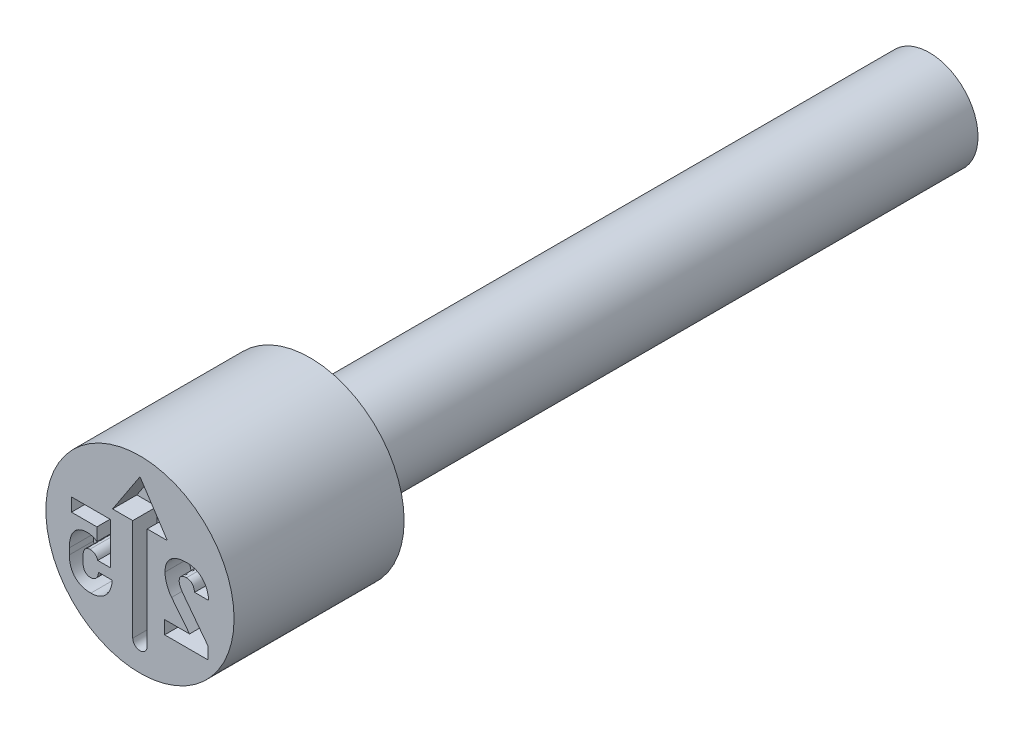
from build123d import *

# Parameters (mm, degrees)
CUT_EXTRUDE4_DEPTH = 0.4
CUT_EXTRUDE5_DEPTH = 0.4


with BuildPart() as part:
    # Sketch2 → Revolve1 (revolve)
    with BuildSketch(Plane(origin=(0, 0, 0), x_dir=(0, 0, -1), z_dir=(1, 0, 0)), mode=Mode.PRIVATE) as revolve1_sk:
        Polygon((0, 1.55), (0, 0), (13, 0), (13, 0.8), (2.8, 0.8), (2.8, 1.55), align=None)
    revolve(revolve1_sk.sketch.rotate(Axis((0, 0, -0.403888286), (0, 0, -1)), 90), axis=Axis((0, 0, -0.403888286), (0, 0, -1)))

    # Sketch3 → Cut-Extrude4 (cut)
    with BuildSketch(Plane.XY):
        with BuildLine():
            Line((0.119045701, 0.566469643), (0.119045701, -1.110101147))
            ThreePointArc((0.119045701, -1.110101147), (0, -1.229146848), (-0.119045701, -1.110101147))
            Line((-0.119045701, -1.110101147), (-0.119045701, 0.566469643))
            Line((-0.119045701, 0.566469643), (-0.451198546, 0.566469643))
            Line((-0.451198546, 0.566469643), (0, 1.251322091))
            Line((0, 1.251322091), (0.451198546, 0.566469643))
            Line((0.451198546, 0.566469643), (0.119045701, 0.566469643))
        make_face()
    extrude(amount=-CUT_EXTRUDE4_DEPTH, mode=Mode.SUBTRACT)

    # Sketch4 → Cut-Extrude5 (cut)
    with BuildSketch(Plane.XY):
        with BuildLine():
            Line((1.116305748, -0.596046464), (0.704485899, -0.054615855))
            add(Edge.make_bspline(
                [(0.704485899, -0.054615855), (0.695848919, -0.042632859), (0.678987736, -0.019239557), (0.663902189, 0.013026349), (0.654318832, 0.038326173), (0.649888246, 0.056678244), (0.646608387, 0.074226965), (0.64622604, 0.085740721), (0.646038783, 0.091379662)],
                knots=[0, 0, 0, 0, 1.660423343, 3.241491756, 3.993801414, 4.704207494, 5.365376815, 6, 6, 6, 6], degree=3))
            Line((0.646038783, 0.091379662), (0.646038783, 0.093091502))
            add(Edge.make_bspline(
                [(0.646038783, 0.093091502), (0.646366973, 0.100797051), (0.646992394, 0.115481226), (0.653030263, 0.136140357), (0.663014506, 0.15400486), (0.676999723, 0.168980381), (0.694789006, 0.18048976), (0.715772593, 0.188897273), (0.740061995, 0.193654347), (0.757287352, 0.194260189), (0.766356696, 0.194579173)],
                knots=[0, 0, 0, 0, 1.033361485, 1.969238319, 2.861873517, 3.760870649, 4.693536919, 5.686153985, 6.781734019, 8, 8, 8, 8], degree=3))
            add(Edge.make_bspline(
                [(0.766356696, 0.194579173), (0.775287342, 0.194201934), (0.792618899, 0.193469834), (0.817273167, 0.186493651), (0.839174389, 0.174650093), (0.858133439, 0.158282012), (0.8740418, 0.137690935), (0.885767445, 0.112885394), (0.8952103, 0.08469284), (0.897950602, 0.064231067), (0.899391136, 0.053474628)],
                knots=[0, 0, 0, 0, 0.993701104, 1.928459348, 2.826878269, 3.748294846, 4.700551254, 5.70417143, 6.793118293, 8, 8, 8, 8], degree=3))
            Line((0.899391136, 0.053474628), (1.131223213, 0.052496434))
            add(Edge.make_bspline(
                [(1.131223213, 0.052496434), (1.129562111, 0.071540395), (1.126326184, 0.106733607), (1.115323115, 0.157344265), (1.099068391, 0.203913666), (1.078300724, 0.246570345), (1.052835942, 0.284775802), (1.023289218, 0.318519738), (0.989333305, 0.347146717), (0.951556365, 0.370934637), (0.910123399, 0.389551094), (0.865541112, 0.403115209), (0.817742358, 0.41093477), (0.784889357, 0.411951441), (0.768068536, 0.412471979)],
                knots=[0, 0, 0, 0, 1.143950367, 2.228484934, 3.258162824, 4.249580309, 5.213917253, 6.146796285, 7.070112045, 8.006232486, 8.954636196, 9.927630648, 10.9389416, 12, 12, 12, 12], degree=3))
            add(Edge.make_bspline(
                [(0.768068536, 0.412471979), (0.750031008, 0.4120949), (0.715120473, 0.411365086), (0.664851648, 0.404494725), (0.618628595, 0.393061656), (0.576567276, 0.376998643), (0.538943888, 0.356350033), (0.505584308, 0.331840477), (0.477430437, 0.302518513), (0.454011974, 0.269208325), (0.435551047, 0.232038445), (0.42262292, 0.191040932), (0.414705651, 0.146545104), (0.413730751, 0.115623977), (0.413228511, 0.099694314)],
                knots=[0, 0, 0, 0, 1.208591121, 2.339154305, 3.392741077, 4.394302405, 5.348037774, 6.261656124, 7.158186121, 8.060194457, 8.981460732, 9.928425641, 10.932785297, 12, 12, 12, 12], degree=3))
            add(Edge.make_bspline(
                [(0.413228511, 0.099694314), (0.413542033, 0.085085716), (0.414169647, 0.057800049), (0.419767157, 0.017036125), (0.428919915, -0.023492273), (0.441338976, -0.063643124), (0.456846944, -0.102745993), (0.475354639, -0.140177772), (0.49648484, -0.175842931), (0.513042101, -0.19789987), (0.521318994, -0.208926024)],
                knots=[0, 0, 0, 0, 0.985191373, 1.972179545, 2.968870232, 3.986806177, 5.007996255, 6.007036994, 7.003727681, 8, 8, 8, 8], degree=3))
            Line((0.521318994, -0.208926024), (0.816733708, -0.582107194))
            Line((0.816733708, -0.582107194), (0.406625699, -0.582107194))
            Line((0.406625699, -0.582107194), (0.406625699, -0.8))
            Line((0.406625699, -0.8), (1.116305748, -0.8))
            Line((1.116305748, -0.8), (1.116305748, -0.596046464))
        make_face()
        with BuildLine():
            add(Edge.make_bspline(
                [(-0.808546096, -0.812471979), (-0.79277451, -0.811990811), (-0.761912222, -0.811049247), (-0.71692598, -0.8025966), (-0.674277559, -0.789506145), (-0.634284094, -0.77083172), (-0.597380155, -0.74710642), (-0.564381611, -0.718094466), (-0.534985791, -0.684555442), (-0.509782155, -0.646195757), (-0.489025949, -0.603425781), (-0.47286688, -0.556749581), (-0.461768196, -0.506251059), (-0.458541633, -0.471216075), (-0.456885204, -0.453230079)],
                knots=[0, 0, 0, 0, 1.013165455, 1.982590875, 2.932437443, 3.87502652, 4.811241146, 5.743574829, 6.690699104, 7.67044025, 8.68537997, 9.739549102, 10.839546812, 12, 12, 12, 12], degree=3))
            Line((-0.456885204, -0.453230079), (-0.683092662, -0.452496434))
            add(Edge.make_bspline(
                [(-0.683092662, -0.452496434), (-0.684384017, -0.463733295), (-0.686845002, -0.483749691), (-0.695719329, -0.511526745), (-0.707305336, -0.535942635), (-0.722609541, -0.556429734), (-0.740783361, -0.57306234), (-0.762318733, -0.584342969), (-0.786119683, -0.591870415), (-0.803023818, -0.592528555), (-0.811725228, -0.592867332)],
                knots=[0, 0, 0, 0, 1.202223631, 2.291125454, 3.30376979, 4.265156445, 5.185306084, 6.082185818, 7.012804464, 8, 8, 8, 8], degree=3))
            add(Edge.make_bspline(
                [(-0.811725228, -0.592867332), (-0.821156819, -0.592456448), (-0.839197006, -0.591670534), (-0.864483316, -0.58408531), (-0.886496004, -0.571941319), (-0.904678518, -0.55446673), (-0.919183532, -0.532693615), (-0.929451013, -0.50662024), (-0.935531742, -0.476660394), (-0.93613013, -0.455380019), (-0.936445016, -0.444181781)],
                knots=[0, 0, 0, 0, 1.026088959, 1.96264217, 2.850204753, 3.743092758, 4.68486217, 5.681854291, 6.780136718, 8, 8, 8, 8], degree=3))
            Line((-0.936445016, -0.444181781), (-0.936445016, -0.343672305))
            add(Edge.make_bspline(
                [(-0.936445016, -0.343672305), (-0.936203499, -0.332474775), (-0.935745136, -0.311223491), (-0.930043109, -0.281496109), (-0.921177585, -0.255559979), (-0.908084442, -0.234029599), (-0.89180832, -0.216651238), (-0.872112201, -0.204308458), (-0.849391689, -0.19701866), (-0.833300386, -0.196164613), (-0.824930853, -0.195720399)],
                knots=[0, 0, 0, 0, 1.281587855, 2.432267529, 3.454745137, 4.406485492, 5.298532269, 6.159104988, 7.042499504, 8, 8, 8, 8], degree=3))
            add(Edge.make_bspline(
                [(-0.824930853, -0.195720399), (-0.817079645, -0.195959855), (-0.801879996, -0.196423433), (-0.779994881, -0.201223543), (-0.759880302, -0.209077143), (-0.741764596, -0.220180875), (-0.725764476, -0.233789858), (-0.71259136, -0.250233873), (-0.701548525, -0.2688147), (-0.696940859, -0.282750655), (-0.694586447, -0.289871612)],
                knots=[0, 0, 0, 0, 1.085085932, 2.100686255, 3.083167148, 4.060192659, 5.028057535, 5.974180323, 6.964852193, 8, 8, 8, 8], degree=3))
            Line((-0.694586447, -0.289871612), (-0.483296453, -0.289871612))
            Line((-0.483296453, -0.289871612), (-0.483296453, 0.4))
            Line((-0.483296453, 0.4), (-1.127926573, 0.4))
            Line((-1.127926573, 0.4), (-1.127926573, 0.182107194))
            Line((-1.127926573, 0.182107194), (-0.709503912, 0.182107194))
            Line((-0.709503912, 0.182107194), (-0.709503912, -0.029916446))
            add(Edge.make_bspline(
                [(-0.709503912, -0.029916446), (-0.714056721, -0.025885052), (-0.723422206, -0.017592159), (-0.739795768, -0.007062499), (-0.758522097, 0.001880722), (-0.786154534, 0.012180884), (-0.822503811, 0.021340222), (-0.852344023, 0.022882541), (-0.866993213, 0.023639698)],
                knots=[0, 0, 0, 0, 0.643749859, 1.324243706, 2.054464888, 2.839075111, 4.448235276, 6, 6, 6, 6], degree=3))
            add(Edge.make_bspline(
                [(-0.866993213, 0.023639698), (-0.882032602, 0.023163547), (-0.911201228, 0.022240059), (-0.953274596, 0.013933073), (-0.992049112, 0.000624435), (-1.027204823, -0.018549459), (-1.058781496, -0.042581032), (-1.086208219, -0.071945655), (-1.109655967, -0.106164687), (-1.128845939, -0.145261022), (-1.143949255, -0.188892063), (-1.154919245, -0.236753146), (-1.161170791, -0.288890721), (-1.161985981, -0.324988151), (-1.162407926, -0.343672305)],
                knots=[0, 0, 0, 0, 1.012739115, 1.964189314, 2.878178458, 3.765675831, 4.65138573, 5.541464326, 6.461953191, 7.437418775, 8.467828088, 9.567356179, 10.740855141, 12, 12, 12, 12], degree=3))
            Line((-1.162407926, -0.343672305), (-1.162407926, -0.444181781))
            add(Edge.make_bspline(
                [(-1.162407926, -0.444181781), (-1.161872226, -0.462871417), (-1.160835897, -0.499027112), (-1.15342506, -0.551310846), (-1.140065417, -0.599270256), (-1.122165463, -0.643215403), (-1.098791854, -0.682273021), (-1.070803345, -0.716773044), (-1.037689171, -0.745918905), (-1.000230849, -0.770447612), (-0.958071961, -0.789259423), (-0.911886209, -0.802925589), (-0.86149082, -0.811054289), (-0.826591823, -0.811988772), (-0.808546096, -0.812471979)],
                knots=[0, 0, 0, 0, 1.159103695, 2.242322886, 3.265299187, 4.239894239, 5.17631577, 6.078070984, 6.98412447, 7.901225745, 8.844758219, 9.836512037, 10.881294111, 12, 12, 12, 12], degree=3))
        make_face()
    extrude(amount=-CUT_EXTRUDE5_DEPTH, mode=Mode.SUBTRACT)


solid = part.part
